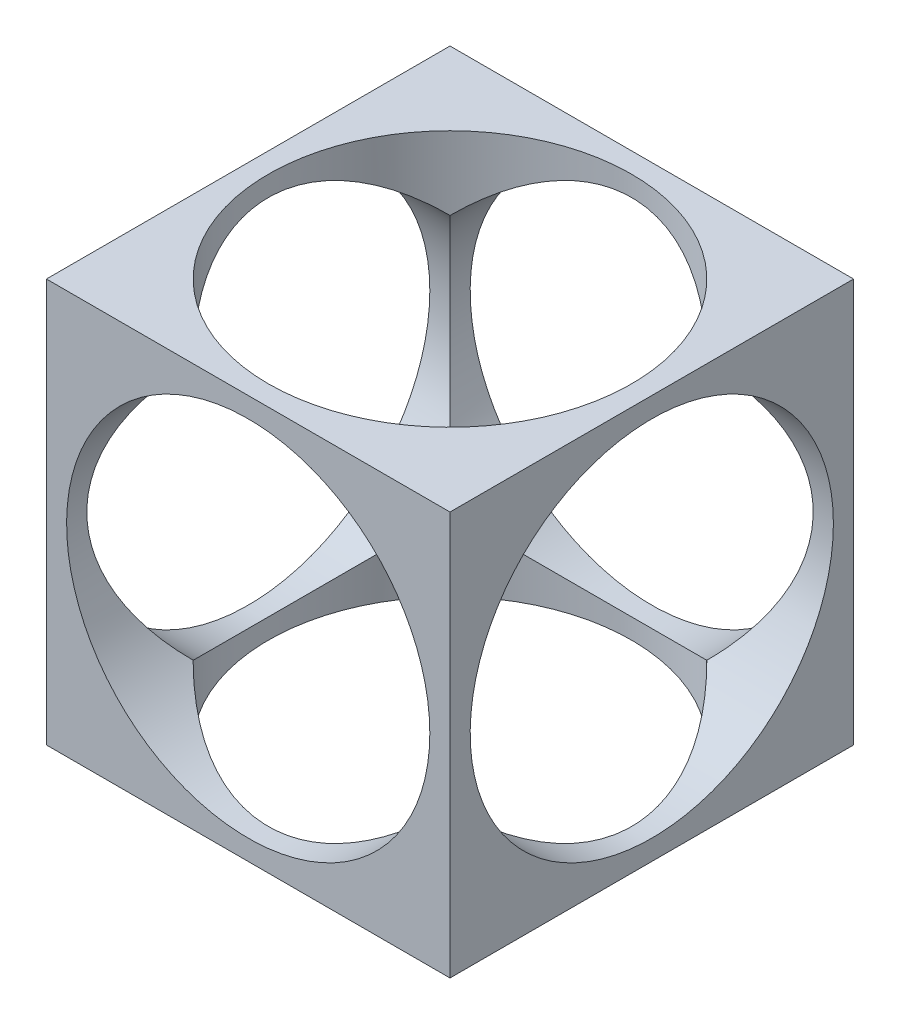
ISO-10303-21;
HEADER;
FILE_DESCRIPTION(('STEP AP214'),'2;1');
FILE_NAME('part.step','',(''),(''),'','','');
FILE_SCHEMA(('AUTOMOTIVE_DESIGN { 1 0 10303 214 1 1 1 1 }'));
ENDSEC;
DATA;
#1=APPLICATION_CONTEXT('core data for automotive mechanical design processes');
#2=APPLICATION_PROTOCOL_DEFINITION('international standard','automotive_design',2000,#1);
#3=PRODUCT_CONTEXT('',#1,'mechanical');
#4=PRODUCT('Part','Part','',(#3));
#5=PRODUCT_RELATED_PRODUCT_CATEGORY('part','',(#4));
#6=PRODUCT_DEFINITION_FORMATION('','',#4);
#7=PRODUCT_DEFINITION_CONTEXT('part definition',#1,'design');
#8=PRODUCT_DEFINITION('design','',#6,#7);
#9=PRODUCT_DEFINITION_SHAPE('','',#8);
#10=(LENGTH_UNIT() NAMED_UNIT(*) SI_UNIT(.MILLI.,.METRE.));
#11=(NAMED_UNIT(*) PLANE_ANGLE_UNIT() SI_UNIT($,.RADIAN.));
#12=(NAMED_UNIT(*) SI_UNIT($,.STERADIAN.) SOLID_ANGLE_UNIT());
#13=UNCERTAINTY_MEASURE_WITH_UNIT(LENGTH_MEASURE(1.E-05),#10,'distance_accuracy_value','');
#14=(GEOMETRIC_REPRESENTATION_CONTEXT(3) GLOBAL_UNCERTAINTY_ASSIGNED_CONTEXT((#13)) GLOBAL_UNIT_ASSIGNED_CONTEXT((#10,
#11,#12)) REPRESENTATION_CONTEXT('',''));
#15=CARTESIAN_POINT('',(0.,0.,0.));
#16=DIRECTION('',(0.,0.,1.));
#17=DIRECTION('',(1.,0.,0.));
#18=AXIS2_PLACEMENT_3D('',#15,#16,#17);
#19=CARTESIAN_POINT('',(100.,50.,50.));
#20=DIRECTION('',(-1.,0.,0.));
#21=DIRECTION('',(0.,0.,1.));
#22=AXIS2_PLACEMENT_3D('',#19,#20,#21);
#23=CYLINDRICAL_SURFACE('',#22,45.);
#24=CARTESIAN_POINT('',(0.,50.,50.));
#25=DIRECTION('',(1.,0.,0.));
#26=DIRECTION('',(0.,0.,-1.));
#27=AXIS2_PLACEMENT_3D('',#24,#25,#26);
#28=CIRCLE('',#27,45.);
#29=CARTESIAN_POINT('',(0.,50.,5.00000000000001));
#30=VERTEX_POINT('',#29);
#31=EDGE_CURVE('E152',#30,#30,#28,.T.);
#32=ORIENTED_EDGE('',*,*,#31,.F.);
#33=EDGE_LOOP('',(#32));
#34=FACE_BOUND('',#33,.T.);
#35=CARTESIAN_POINT('',(50.,50.,50.));
#36=DIRECTION('',(-0.707106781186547,0.,0.707106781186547));
#37=DIRECTION('',(-0.707106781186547,0.,-0.707106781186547));
#38=AXIS2_PLACEMENT_3D('',#35,#36,#37);
#39=ELLIPSE('',#38,63.6396103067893,45.);
#40=CARTESIAN_POINT('',(18.1801948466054,18.1801948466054,18.1801948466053));
#41=VERTEX_POINT('',#40);
#42=CARTESIAN_POINT('',(18.1801948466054,81.8198051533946,18.1801948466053));
#43=VERTEX_POINT('',#42);
#44=EDGE_CURVE('E109',#41,#43,#39,.F.);
#45=ORIENTED_EDGE('',*,*,#44,.T.);
#46=CARTESIAN_POINT('',(50.,50.,50.));
#47=DIRECTION('',(-0.707106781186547,-0.707106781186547,0.));
#48=DIRECTION('',(-0.707106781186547,0.707106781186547,0.));
#49=AXIS2_PLACEMENT_3D('',#46,#47,#48);
#50=ELLIPSE('',#49,63.6396103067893,45.);
#51=CARTESIAN_POINT('',(18.1801948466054,81.8198051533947,81.8198051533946));
#52=VERTEX_POINT('',#51);
#53=EDGE_CURVE('E98',#43,#52,#50,.F.);
#54=ORIENTED_EDGE('',*,*,#53,.T.);
#55=CARTESIAN_POINT('',(50.,50.,50.));
#56=DIRECTION('',(-0.707106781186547,0.,-0.707106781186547));
#57=DIRECTION('',(-0.707106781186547,0.,0.707106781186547));
#58=AXIS2_PLACEMENT_3D('',#55,#56,#57);
#59=ELLIPSE('',#58,63.6396103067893,45.);
#60=CARTESIAN_POINT('',(18.1801948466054,18.1801948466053,81.8198051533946));
#61=VERTEX_POINT('',#60);
#62=EDGE_CURVE('E104',#52,#61,#59,.F.);
#63=ORIENTED_EDGE('',*,*,#62,.T.);
#64=CARTESIAN_POINT('',(50.,50.,50.));
#65=DIRECTION('',(-0.707106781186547,0.707106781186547,0.));
#66=DIRECTION('',(-0.707106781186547,-0.707106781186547,0.));
#67=AXIS2_PLACEMENT_3D('',#64,#65,#66);
#68=ELLIPSE('',#67,63.6396103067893,45.);
#69=EDGE_CURVE('E49',#61,#41,#68,.F.);
#70=ORIENTED_EDGE('',*,*,#69,.T.);
#71=EDGE_LOOP('',(#45,#54,#63,#70));
#72=FACE_BOUND('',#71,.T.);
#73=ADVANCED_FACE('F34',(#34,#72),#23,.F.);
#74=CARTESIAN_POINT('',(100.,50.,50.));
#75=DIRECTION('',(1.,0.,0.));
#76=DIRECTION('',(0.,0.,-1.));
#77=AXIS2_PLACEMENT_3D('',#74,#75,#76);
#78=CIRCLE('',#77,45.);
#79=CARTESIAN_POINT('',(100.,50.,5.00000000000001));
#80=VERTEX_POINT('',#79);
#81=EDGE_CURVE('E144',#80,#80,#78,.T.);
#82=ORIENTED_EDGE('',*,*,#81,.T.);
#83=EDGE_LOOP('',(#82));
#84=FACE_BOUND('',#83,.T.);
#85=CARTESIAN_POINT('',(50.,50.,50.));
#86=DIRECTION('',(-0.707106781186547,0.,-0.707106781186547));
#87=DIRECTION('',(-0.707106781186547,0.,0.707106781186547));
#88=AXIS2_PLACEMENT_3D('',#85,#86,#87);
#89=ELLIPSE('',#88,63.6396103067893,45.);
#90=CARTESIAN_POINT('',(81.8198051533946,81.8198051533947,18.1801948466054));
#91=VERTEX_POINT('',#90);
#92=CARTESIAN_POINT('',(81.8198051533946,18.1801948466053,18.1801948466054));
#93=VERTEX_POINT('',#92);
#94=EDGE_CURVE('E113',#91,#93,#89,.T.);
#95=ORIENTED_EDGE('',*,*,#94,.T.);
#96=CARTESIAN_POINT('',(50.,50.,50.));
#97=DIRECTION('',(-0.707106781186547,-0.707106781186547,0.));
#98=DIRECTION('',(-0.707106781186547,0.707106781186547,0.));
#99=AXIS2_PLACEMENT_3D('',#96,#97,#98);
#100=ELLIPSE('',#99,63.6396103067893,45.);
#101=CARTESIAN_POINT('',(81.8198051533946,18.1801948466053,81.8198051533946));
#102=VERTEX_POINT('',#101);
#103=EDGE_CURVE('E167',#93,#102,#100,.T.);
#104=ORIENTED_EDGE('',*,*,#103,.T.);
#105=CARTESIAN_POINT('',(50.,50.,50.));
#106=DIRECTION('',(-0.707106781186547,0.,0.707106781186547));
#107=DIRECTION('',(-0.707106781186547,0.,-0.707106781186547));
#108=AXIS2_PLACEMENT_3D('',#105,#106,#107);
#109=ELLIPSE('',#108,63.6396103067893,45.);
#110=CARTESIAN_POINT('',(81.8198051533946,81.8198051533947,81.8198051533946));
#111=VERTEX_POINT('',#110);
#112=EDGE_CURVE('E116',#102,#111,#109,.T.);
#113=ORIENTED_EDGE('',*,*,#112,.T.);
#114=CARTESIAN_POINT('',(50.,50.,50.));
#115=DIRECTION('',(-0.707106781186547,0.707106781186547,0.));
#116=DIRECTION('',(-0.707106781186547,-0.707106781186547,0.));
#117=AXIS2_PLACEMENT_3D('',#114,#115,#116);
#118=ELLIPSE('',#117,63.6396103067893,45.);
#119=EDGE_CURVE('E56',#111,#91,#118,.T.);
#120=ORIENTED_EDGE('',*,*,#119,.T.);
#121=EDGE_LOOP('',(#95,#104,#113,#120));
#122=FACE_BOUND('',#121,.T.);
#123=ADVANCED_FACE('F191',(#84,#122),#23,.F.);
#124=CARTESIAN_POINT('',(0.,0.,100.));
#125=DIRECTION('',(0.,1.,0.));
#126=DIRECTION('',(0.,0.,1.));
#127=AXIS2_PLACEMENT_3D('',#124,#125,#126);
#128=PLANE('',#127);
#129=DIRECTION('',(1.,0.,0.));
#130=VECTOR('',#129,1.);
#131=CARTESIAN_POINT('',(0.,0.,0.));
#132=LINE('',#131,#130);
#133=CARTESIAN_POINT('',(0.,0.,0.));
#134=VERTEX_POINT('',#133);
#135=CARTESIAN_POINT('',(100.,0.,0.));
#136=VERTEX_POINT('',#135);
#137=EDGE_CURVE('E139',#134,#136,#132,.T.);
#138=ORIENTED_EDGE('',*,*,#137,.T.);
#139=DIRECTION('',(0.,0.,-1.));
#140=VECTOR('',#139,1.);
#141=CARTESIAN_POINT('',(100.,0.,100.));
#142=LINE('',#141,#140);
#143=CARTESIAN_POINT('',(100.,0.,100.));
#144=VERTEX_POINT('',#143);
#145=EDGE_CURVE('E124',#144,#136,#142,.T.);
#146=ORIENTED_EDGE('',*,*,#145,.F.);
#147=DIRECTION('',(1.,0.,0.));
#148=VECTOR('',#147,1.);
#149=CARTESIAN_POINT('',(0.,0.,100.));
#150=LINE('',#149,#148);
#151=CARTESIAN_POINT('',(0.,0.,100.));
#152=VERTEX_POINT('',#151);
#153=EDGE_CURVE('E148',#152,#144,#150,.T.);
#154=ORIENTED_EDGE('',*,*,#153,.F.);
#155=DIRECTION('',(0.,0.,-1.));
#156=VECTOR('',#155,1.);
#157=CARTESIAN_POINT('',(0.,0.,100.));
#158=LINE('',#157,#156);
#159=EDGE_CURVE('E121',#152,#134,#158,.T.);
#160=ORIENTED_EDGE('',*,*,#159,.T.);
#161=EDGE_LOOP('',(#138,#146,#154,#160));
#162=FACE_BOUND('',#161,.T.);
#163=CARTESIAN_POINT('',(50.,0.,49.9999999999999));
#164=DIRECTION('',(0.,1.,0.));
#165=DIRECTION('',(0.,0.,1.));
#166=AXIS2_PLACEMENT_3D('',#163,#164,#165);
#167=CIRCLE('',#166,45.);
#168=CARTESIAN_POINT('',(50.,0.,94.9999999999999));
#169=VERTEX_POINT('',#168);
#170=EDGE_CURVE('E173',#169,#169,#167,.T.);
#171=ORIENTED_EDGE('',*,*,#170,.T.);
#172=EDGE_LOOP('',(#171));
#173=FACE_BOUND('',#172,.T.);
#174=ADVANCED_FACE('F182',(#162,#173),#128,.F.);
#175=CARTESIAN_POINT('',(0.,100.,100.));
#176=DIRECTION('',(0.,-1.,0.));
#177=DIRECTION('',(0.,0.,-1.));
#178=AXIS2_PLACEMENT_3D('',#175,#176,#177);
#179=PLANE('',#178);
#180=DIRECTION('',(-1.,0.,0.));
#181=VECTOR('',#180,1.);
#182=CARTESIAN_POINT('',(0.,100.,0.));
#183=LINE('',#182,#181);
#184=CARTESIAN_POINT('',(100.,100.,0.));
#185=VERTEX_POINT('',#184);
#186=CARTESIAN_POINT('',(0.,100.,0.));
#187=VERTEX_POINT('',#186);
#188=EDGE_CURVE('E134',#185,#187,#183,.T.);
#189=ORIENTED_EDGE('',*,*,#188,.T.);
#190=DIRECTION('',(0.,0.,-1.));
#191=VECTOR('',#190,1.);
#192=CARTESIAN_POINT('',(0.,100.,100.));
#193=LINE('',#192,#191);
#194=CARTESIAN_POINT('',(0.,100.,100.));
#195=VERTEX_POINT('',#194);
#196=EDGE_CURVE('E130',#195,#187,#193,.T.);
#197=ORIENTED_EDGE('',*,*,#196,.F.);
#198=DIRECTION('',(-1.,0.,0.));
#199=VECTOR('',#198,1.);
#200=CARTESIAN_POINT('',(0.,100.,100.));
#201=LINE('',#200,#199);
#202=CARTESIAN_POINT('',(100.,100.,100.));
#203=VERTEX_POINT('',#202);
#204=EDGE_CURVE('E133',#203,#195,#201,.T.);
#205=ORIENTED_EDGE('',*,*,#204,.F.);
#206=DIRECTION('',(0.,0.,-1.));
#207=VECTOR('',#206,1.);
#208=CARTESIAN_POINT('',(100.,100.,100.));
#209=LINE('',#208,#207);
#210=EDGE_CURVE('E127',#203,#185,#209,.T.);
#211=ORIENTED_EDGE('',*,*,#210,.T.);
#212=EDGE_LOOP('',(#189,#197,#205,#211));
#213=FACE_BOUND('',#212,.T.);
#214=CARTESIAN_POINT('',(50.,100.,49.9999999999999));
#215=DIRECTION('',(0.,1.,0.));
#216=DIRECTION('',(0.,0.,1.));
#217=AXIS2_PLACEMENT_3D('',#214,#215,#216);
#218=CIRCLE('',#217,45.);
#219=CARTESIAN_POINT('',(50.,100.,94.9999999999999));
#220=VERTEX_POINT('',#219);
#221=EDGE_CURVE('E172',#220,#220,#218,.T.);
#222=ORIENTED_EDGE('',*,*,#221,.F.);
#223=EDGE_LOOP('',(#222));
#224=FACE_BOUND('',#223,.T.);
#225=ADVANCED_FACE('F179',(#213,#224),#179,.F.);
#226=CARTESIAN_POINT('',(50.,50.,100.));
#227=DIRECTION('',(0.,0.,-1.));
#228=DIRECTION('',(-1.,0.,0.));
#229=AXIS2_PLACEMENT_3D('',#226,#227,#228);
#230=CYLINDRICAL_SURFACE('',#229,45.);
#231=CARTESIAN_POINT('',(50.,50.,0.));
#232=DIRECTION('',(0.,0.,1.));
#233=DIRECTION('',(1.,0.,0.));
#234=AXIS2_PLACEMENT_3D('',#231,#232,#233);
#235=CIRCLE('',#234,45.);
#236=CARTESIAN_POINT('',(95.,50.,0.));
#237=VERTEX_POINT('',#236);
#238=EDGE_CURVE('E158',#237,#237,#235,.T.);
#239=ORIENTED_EDGE('',*,*,#238,.F.);
#240=EDGE_LOOP('',(#239));
#241=FACE_BOUND('',#240,.T.);
#242=ORIENTED_EDGE('',*,*,#94,.F.);
#243=CARTESIAN_POINT('',(50.,50.,49.9999999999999));
#244=DIRECTION('',(0.,-0.707106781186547,-0.707106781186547));
#245=DIRECTION('',(0.,0.707106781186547,-0.707106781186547));
#246=AXIS2_PLACEMENT_3D('',#243,#244,#245);
#247=ELLIPSE('',#246,63.6396103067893,45.);
#248=EDGE_CURVE('E110',#91,#43,#247,.F.);
#249=ORIENTED_EDGE('',*,*,#248,.T.);
#250=ORIENTED_EDGE('',*,*,#44,.F.);
#251=CARTESIAN_POINT('',(50.,50.,49.9999999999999));
#252=DIRECTION('',(0.,0.707106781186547,-0.707106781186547));
#253=DIRECTION('',(0.,-0.707106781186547,-0.707106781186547));
#254=AXIS2_PLACEMENT_3D('',#251,#252,#253);
#255=ELLIPSE('',#254,63.6396103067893,45.);
#256=EDGE_CURVE('E161',#41,#93,#255,.F.);
#257=ORIENTED_EDGE('',*,*,#256,.T.);
#258=EDGE_LOOP('',(#242,#249,#250,#257));
#259=FACE_BOUND('',#258,.T.);
#260=ADVANCED_FACE('F181',(#241,#259),#230,.F.);
#261=CARTESIAN_POINT('',(50.,50.,100.));
#262=DIRECTION('',(0.,0.,1.));
#263=DIRECTION('',(1.,0.,0.));
#264=AXIS2_PLACEMENT_3D('',#261,#262,#263);
#265=CIRCLE('',#264,45.);
#266=CARTESIAN_POINT('',(95.,50.,100.));
#267=VERTEX_POINT('',#266);
#268=EDGE_CURVE('E155',#267,#267,#265,.T.);
#269=ORIENTED_EDGE('',*,*,#268,.T.);
#270=EDGE_LOOP('',(#269));
#271=FACE_BOUND('',#270,.T.);
#272=ORIENTED_EDGE('',*,*,#112,.F.);
#273=CARTESIAN_POINT('',(50.,50.,49.9999999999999));
#274=DIRECTION('',(0.,-0.707106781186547,-0.707106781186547));
#275=DIRECTION('',(0.,0.707106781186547,-0.707106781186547));
#276=AXIS2_PLACEMENT_3D('',#273,#274,#275);
#277=ELLIPSE('',#276,63.6396103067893,45.);
#278=EDGE_CURVE('E11',#102,#61,#277,.T.);
#279=ORIENTED_EDGE('',*,*,#278,.T.);
#280=ORIENTED_EDGE('',*,*,#62,.F.);
#281=CARTESIAN_POINT('',(50.,50.,49.9999999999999));
#282=DIRECTION('',(0.,0.707106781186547,-0.707106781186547));
#283=DIRECTION('',(0.,-0.707106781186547,-0.707106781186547));
#284=AXIS2_PLACEMENT_3D('',#281,#282,#283);
#285=ELLIPSE('',#284,63.6396103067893,45.);
#286=EDGE_CURVE('E42',#52,#111,#285,.T.);
#287=ORIENTED_EDGE('',*,*,#286,.T.);
#288=EDGE_LOOP('',(#272,#279,#280,#287));
#289=FACE_BOUND('',#288,.T.);
#290=ADVANCED_FACE('F112',(#271,#289),#230,.F.);
#291=CARTESIAN_POINT('',(0.,100.,100.));
#292=DIRECTION('',(0.,0.,-1.));
#293=DIRECTION('',(-1.,0.,0.));
#294=AXIS2_PLACEMENT_3D('',#291,#292,#293);
#295=PLANE('',#294);
#296=DIRECTION('',(0.,-1.,0.));
#297=VECTOR('',#296,1.);
#298=CARTESIAN_POINT('',(0.,0.,100.));
#299=LINE('',#298,#297);
#300=EDGE_CURVE('E136',#195,#152,#299,.T.);
#301=ORIENTED_EDGE('',*,*,#300,.T.);
#302=ORIENTED_EDGE('',*,*,#153,.T.);
#303=DIRECTION('',(0.,1.,0.));
#304=VECTOR('',#303,1.);
#305=CARTESIAN_POINT('',(100.,0.,100.));
#306=LINE('',#305,#304);
#307=EDGE_CURVE('E146',#144,#203,#306,.T.);
#308=ORIENTED_EDGE('',*,*,#307,.T.);
#309=ORIENTED_EDGE('',*,*,#204,.T.);
#310=EDGE_LOOP('',(#301,#302,#308,#309));
#311=FACE_BOUND('',#310,.T.);
#312=ORIENTED_EDGE('',*,*,#268,.F.);
#313=EDGE_LOOP('',(#312));
#314=FACE_BOUND('',#313,.T.);
#315=ADVANCED_FACE('F205',(#311,#314),#295,.F.);
#316=CARTESIAN_POINT('',(0.,100.,0.));
#317=DIRECTION('',(0.,0.,-1.));
#318=DIRECTION('',(-1.,0.,0.));
#319=AXIS2_PLACEMENT_3D('',#316,#317,#318);
#320=PLANE('',#319);
#321=DIRECTION('',(0.,-1.,0.));
#322=VECTOR('',#321,1.);
#323=CARTESIAN_POINT('',(0.,0.,0.));
#324=LINE('',#323,#322);
#325=EDGE_CURVE('E141',#187,#134,#324,.T.);
#326=ORIENTED_EDGE('',*,*,#325,.F.);
#327=ORIENTED_EDGE('',*,*,#188,.F.);
#328=DIRECTION('',(0.,1.,0.));
#329=VECTOR('',#328,1.);
#330=CARTESIAN_POINT('',(100.,0.,0.));
#331=LINE('',#330,#329);
#332=EDGE_CURVE('E137',#136,#185,#331,.T.);
#333=ORIENTED_EDGE('',*,*,#332,.F.);
#334=ORIENTED_EDGE('',*,*,#137,.F.);
#335=EDGE_LOOP('',(#326,#327,#333,#334));
#336=FACE_BOUND('',#335,.T.);
#337=ORIENTED_EDGE('',*,*,#238,.T.);
#338=EDGE_LOOP('',(#337));
#339=FACE_BOUND('',#338,.T.);
#340=ADVANCED_FACE('F207',(#336,#339),#320,.T.);
#341=CARTESIAN_POINT('',(0.,0.,100.));
#342=DIRECTION('',(1.,0.,0.));
#343=DIRECTION('',(0.,0.,-1.));
#344=AXIS2_PLACEMENT_3D('',#341,#342,#343);
#345=PLANE('',#344);
#346=ORIENTED_EDGE('',*,*,#325,.T.);
#347=ORIENTED_EDGE('',*,*,#159,.F.);
#348=ORIENTED_EDGE('',*,*,#300,.F.);
#349=ORIENTED_EDGE('',*,*,#196,.T.);
#350=EDGE_LOOP('',(#346,#347,#348,#349));
#351=FACE_BOUND('',#350,.T.);
#352=ORIENTED_EDGE('',*,*,#31,.T.);
#353=EDGE_LOOP('',(#352));
#354=FACE_BOUND('',#353,.T.);
#355=ADVANCED_FACE('F36',(#351,#354),#345,.F.);
#356=CARTESIAN_POINT('',(100.,0.,100.));
#357=DIRECTION('',(-1.,0.,0.));
#358=DIRECTION('',(0.,0.,1.));
#359=AXIS2_PLACEMENT_3D('',#356,#357,#358);
#360=PLANE('',#359);
#361=ORIENTED_EDGE('',*,*,#332,.T.);
#362=ORIENTED_EDGE('',*,*,#210,.F.);
#363=ORIENTED_EDGE('',*,*,#307,.F.);
#364=ORIENTED_EDGE('',*,*,#145,.T.);
#365=EDGE_LOOP('',(#361,#362,#363,#364));
#366=FACE_BOUND('',#365,.T.);
#367=ORIENTED_EDGE('',*,*,#81,.F.);
#368=EDGE_LOOP('',(#367));
#369=FACE_BOUND('',#368,.T.);
#370=ADVANCED_FACE('F214',(#366,#369),#360,.F.);
#371=CARTESIAN_POINT('',(50.,100.,49.9999999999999));
#372=DIRECTION('',(0.,-1.,0.));
#373=DIRECTION('',(0.,0.,-1.));
#374=AXIS2_PLACEMENT_3D('',#371,#372,#373);
#375=CYLINDRICAL_SURFACE('',#374,45.);
#376=ORIENTED_EDGE('',*,*,#119,.F.);
#377=ORIENTED_EDGE('',*,*,#286,.F.);
#378=ORIENTED_EDGE('',*,*,#53,.F.);
#379=ORIENTED_EDGE('',*,*,#248,.F.);
#380=EDGE_LOOP('',(#376,#377,#378,#379));
#381=FACE_BOUND('',#380,.T.);
#382=ORIENTED_EDGE('',*,*,#221,.T.);
#383=EDGE_LOOP('',(#382));
#384=FACE_BOUND('',#383,.T.);
#385=ADVANCED_FACE('F96',(#381,#384),#375,.F.);
#386=ORIENTED_EDGE('',*,*,#69,.F.);
#387=ORIENTED_EDGE('',*,*,#278,.F.);
#388=ORIENTED_EDGE('',*,*,#103,.F.);
#389=ORIENTED_EDGE('',*,*,#256,.F.);
#390=EDGE_LOOP('',(#386,#387,#388,#389));
#391=FACE_BOUND('',#390,.T.);
#392=ORIENTED_EDGE('',*,*,#170,.F.);
#393=EDGE_LOOP('',(#392));
#394=FACE_BOUND('',#393,.T.);
#395=ADVANCED_FACE('F223',(#391,#394),#375,.F.);
#396=CLOSED_SHELL('',(#73,#123,#174,#225,#260,#290,#315,#340,#355,#370,#385,#395));
#397=MANIFOLD_SOLID_BREP('B2',#396);
#398=ADVANCED_BREP_SHAPE_REPRESENTATION('',(#18,#397),#14);
#399=SHAPE_DEFINITION_REPRESENTATION(#9,#398);
ENDSEC;
END-ISO-10303-21;
